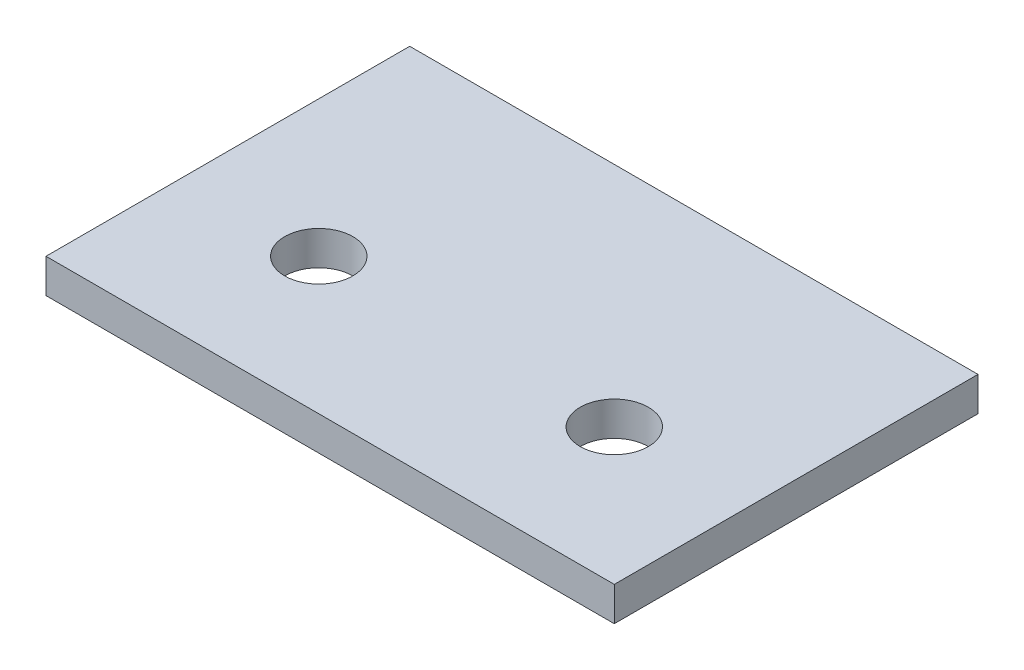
ISO-10303-21;
HEADER;
FILE_DESCRIPTION(('STEP AP214'),'2;1');
FILE_NAME('part.step','',(''),(''),'','','');
FILE_SCHEMA(('AUTOMOTIVE_DESIGN { 1 0 10303 214 1 1 1 1 }'));
ENDSEC;
DATA;
#1=APPLICATION_CONTEXT('core data for automotive mechanical design processes');
#2=APPLICATION_PROTOCOL_DEFINITION('international standard','automotive_design',2000,#1);
#3=PRODUCT_CONTEXT('',#1,'mechanical');
#4=PRODUCT('Part','Part','',(#3));
#5=PRODUCT_RELATED_PRODUCT_CATEGORY('part','',(#4));
#6=PRODUCT_DEFINITION_FORMATION('','',#4);
#7=PRODUCT_DEFINITION_CONTEXT('part definition',#1,'design');
#8=PRODUCT_DEFINITION('design','',#6,#7);
#9=PRODUCT_DEFINITION_SHAPE('','',#8);
#10=(LENGTH_UNIT() NAMED_UNIT(*) SI_UNIT(.MILLI.,.METRE.));
#11=(NAMED_UNIT(*) PLANE_ANGLE_UNIT() SI_UNIT($,.RADIAN.));
#12=(NAMED_UNIT(*) SI_UNIT($,.STERADIAN.) SOLID_ANGLE_UNIT());
#13=UNCERTAINTY_MEASURE_WITH_UNIT(LENGTH_MEASURE(1.E-05),#10,'distance_accuracy_value','');
#14=(GEOMETRIC_REPRESENTATION_CONTEXT(3) GLOBAL_UNCERTAINTY_ASSIGNED_CONTEXT((#13)) GLOBAL_UNIT_ASSIGNED_CONTEXT((#10,
#11,#12)) REPRESENTATION_CONTEXT('',''));
#15=CARTESIAN_POINT('',(0.,0.,0.));
#16=DIRECTION('',(0.,0.,1.));
#17=DIRECTION('',(1.,0.,0.));
#18=AXIS2_PLACEMENT_3D('',#15,#16,#17);
#19=CARTESIAN_POINT('',(0.,1.5,0.));
#20=DIRECTION('',(0.,-1.,0.));
#21=DIRECTION('',(0.,0.,-1.));
#22=AXIS2_PLACEMENT_3D('',#19,#20,#21);
#23=PLANE('',#22);
#24=DIRECTION('',(0.,0.,1.));
#25=VECTOR('',#24,1.);
#26=CARTESIAN_POINT('',(0.,1.5,0.));
#27=LINE('',#26,#25);
#28=CARTESIAN_POINT('',(0.,1.5,-16.));
#29=VERTEX_POINT('',#28);
#30=CARTESIAN_POINT('',(0.,1.5,0.));
#31=VERTEX_POINT('',#30);
#32=EDGE_CURVE('E84',#29,#31,#27,.T.);
#33=ORIENTED_EDGE('',*,*,#32,.T.);
#34=DIRECTION('',(1.,0.,0.));
#35=VECTOR('',#34,1.);
#36=CARTESIAN_POINT('',(0.,1.5,0.));
#37=LINE('',#36,#35);
#38=CARTESIAN_POINT('',(25.,1.5,0.));
#39=VERTEX_POINT('',#38);
#40=EDGE_CURVE('E79',#31,#39,#37,.T.);
#41=ORIENTED_EDGE('',*,*,#40,.T.);
#42=DIRECTION('',(0.,0.,-1.));
#43=VECTOR('',#42,1.);
#44=CARTESIAN_POINT('',(25.,1.5,0.));
#45=LINE('',#44,#43);
#46=CARTESIAN_POINT('',(25.,1.5,-16.));
#47=VERTEX_POINT('',#46);
#48=EDGE_CURVE('E82',#39,#47,#45,.T.);
#49=ORIENTED_EDGE('',*,*,#48,.T.);
#50=DIRECTION('',(-1.,0.,0.));
#51=VECTOR('',#50,1.);
#52=CARTESIAN_POINT('',(0.,1.5,-16.));
#53=LINE('',#52,#51);
#54=EDGE_CURVE('E49',#47,#29,#53,.T.);
#55=ORIENTED_EDGE('',*,*,#54,.T.);
#56=EDGE_LOOP('',(#33,#41,#49,#55));
#57=FACE_BOUND('',#56,.T.);
#58=CARTESIAN_POINT('',(6.,1.5,-6.));
#59=DIRECTION('',(0.,1.,0.));
#60=DIRECTION('',(0.,0.,1.));
#61=AXIS2_PLACEMENT_3D('',#58,#59,#60);
#62=CIRCLE('',#61,1.5);
#63=CARTESIAN_POINT('',(6.,1.5,-4.5));
#64=VERTEX_POINT('',#63);
#65=EDGE_CURVE('E99',#64,#64,#62,.T.);
#66=ORIENTED_EDGE('',*,*,#65,.F.);
#67=EDGE_LOOP('',(#66));
#68=FACE_BOUND('',#67,.T.);
#69=CARTESIAN_POINT('',(19.,1.5,-6.));
#70=DIRECTION('',(0.,1.,0.));
#71=DIRECTION('',(0.,0.,1.));
#72=AXIS2_PLACEMENT_3D('',#69,#70,#71);
#73=CIRCLE('',#72,1.5);
#74=CARTESIAN_POINT('',(19.,1.5,-4.5));
#75=VERTEX_POINT('',#74);
#76=EDGE_CURVE('E114',#75,#75,#73,.T.);
#77=ORIENTED_EDGE('',*,*,#76,.F.);
#78=EDGE_LOOP('',(#77));
#79=FACE_BOUND('',#78,.T.);
#80=ADVANCED_FACE('F32',(#57,#68,#79),#23,.F.);
#81=CARTESIAN_POINT('',(0.,0.,0.));
#82=DIRECTION('',(0.,-1.,0.));
#83=DIRECTION('',(0.,0.,-1.));
#84=AXIS2_PLACEMENT_3D('',#81,#82,#83);
#85=PLANE('',#84);
#86=CARTESIAN_POINT('',(6.,0.,-6.));
#87=DIRECTION('',(0.,1.,0.));
#88=DIRECTION('',(0.,0.,1.));
#89=AXIS2_PLACEMENT_3D('',#86,#87,#88);
#90=CIRCLE('',#89,1.5);
#91=CARTESIAN_POINT('',(6.,0.,-4.5));
#92=VERTEX_POINT('',#91);
#93=EDGE_CURVE('E111',#92,#92,#90,.T.);
#94=ORIENTED_EDGE('',*,*,#93,.T.);
#95=EDGE_LOOP('',(#94));
#96=FACE_BOUND('',#95,.T.);
#97=DIRECTION('',(0.,0.,1.));
#98=VECTOR('',#97,1.);
#99=CARTESIAN_POINT('',(0.,0.,0.));
#100=LINE('',#99,#98);
#101=CARTESIAN_POINT('',(0.,0.,-16.));
#102=VERTEX_POINT('',#101);
#103=CARTESIAN_POINT('',(0.,0.,0.));
#104=VERTEX_POINT('',#103);
#105=EDGE_CURVE('E96',#102,#104,#100,.T.);
#106=ORIENTED_EDGE('',*,*,#105,.F.);
#107=DIRECTION('',(-1.,0.,0.));
#108=VECTOR('',#107,1.);
#109=CARTESIAN_POINT('',(0.,0.,-16.));
#110=LINE('',#109,#108);
#111=CARTESIAN_POINT('',(25.,0.,-16.));
#112=VERTEX_POINT('',#111);
#113=EDGE_CURVE('E72',#112,#102,#110,.T.);
#114=ORIENTED_EDGE('',*,*,#113,.F.);
#115=DIRECTION('',(0.,0.,-1.));
#116=VECTOR('',#115,1.);
#117=CARTESIAN_POINT('',(25.,0.,0.));
#118=LINE('',#117,#116);
#119=CARTESIAN_POINT('',(25.,0.,0.));
#120=VERTEX_POINT('',#119);
#121=EDGE_CURVE('E66',#120,#112,#118,.T.);
#122=ORIENTED_EDGE('',*,*,#121,.F.);
#123=DIRECTION('',(1.,0.,0.));
#124=VECTOR('',#123,1.);
#125=CARTESIAN_POINT('',(0.,0.,0.));
#126=LINE('',#125,#124);
#127=EDGE_CURVE('E88',#104,#120,#126,.T.);
#128=ORIENTED_EDGE('',*,*,#127,.F.);
#129=EDGE_LOOP('',(#106,#114,#122,#128));
#130=FACE_BOUND('',#129,.T.);
#131=CARTESIAN_POINT('',(19.,0.,-6.));
#132=DIRECTION('',(0.,1.,0.));
#133=DIRECTION('',(0.,0.,1.));
#134=AXIS2_PLACEMENT_3D('',#131,#132,#133);
#135=CIRCLE('',#134,1.5);
#136=CARTESIAN_POINT('',(19.,0.,-4.5));
#137=VERTEX_POINT('',#136);
#138=EDGE_CURVE('E117',#137,#137,#135,.T.);
#139=ORIENTED_EDGE('',*,*,#138,.T.);
#140=EDGE_LOOP('',(#139));
#141=FACE_BOUND('',#140,.T.);
#142=ADVANCED_FACE('F107',(#96,#130,#141),#85,.T.);
#143=CARTESIAN_POINT('',(0.,1.5,0.));
#144=DIRECTION('',(1.,0.,0.));
#145=DIRECTION('',(0.,0.,-1.));
#146=AXIS2_PLACEMENT_3D('',#143,#144,#145);
#147=PLANE('',#146);
#148=ORIENTED_EDGE('',*,*,#105,.T.);
#149=DIRECTION('',(0.,-1.,0.));
#150=VECTOR('',#149,1.);
#151=CARTESIAN_POINT('',(0.,1.5,0.));
#152=LINE('',#151,#150);
#153=EDGE_CURVE('E11',#31,#104,#152,.T.);
#154=ORIENTED_EDGE('',*,*,#153,.F.);
#155=ORIENTED_EDGE('',*,*,#32,.F.);
#156=DIRECTION('',(0.,-1.,0.));
#157=VECTOR('',#156,1.);
#158=CARTESIAN_POINT('',(0.,1.5,-16.));
#159=LINE('',#158,#157);
#160=EDGE_CURVE('E92',#29,#102,#159,.T.);
#161=ORIENTED_EDGE('',*,*,#160,.T.);
#162=EDGE_LOOP('',(#148,#154,#155,#161));
#163=FACE_BOUND('',#162,.T.);
#164=ADVANCED_FACE('F34',(#163),#147,.F.);
#165=CARTESIAN_POINT('',(0.,1.5,0.));
#166=DIRECTION('',(0.,0.,-1.));
#167=DIRECTION('',(-1.,0.,0.));
#168=AXIS2_PLACEMENT_3D('',#165,#166,#167);
#169=PLANE('',#168);
#170=ORIENTED_EDGE('',*,*,#127,.T.);
#171=DIRECTION('',(0.,-1.,0.));
#172=VECTOR('',#171,1.);
#173=CARTESIAN_POINT('',(25.,1.5,0.));
#174=LINE('',#173,#172);
#175=EDGE_CURVE('E41',#39,#120,#174,.T.);
#176=ORIENTED_EDGE('',*,*,#175,.F.);
#177=ORIENTED_EDGE('',*,*,#40,.F.);
#178=ORIENTED_EDGE('',*,*,#153,.T.);
#179=EDGE_LOOP('',(#170,#176,#177,#178));
#180=FACE_BOUND('',#179,.T.);
#181=ADVANCED_FACE('F87',(#180),#169,.F.);
#182=CARTESIAN_POINT('',(25.,1.5,0.));
#183=DIRECTION('',(-1.,0.,0.));
#184=DIRECTION('',(0.,0.,1.));
#185=AXIS2_PLACEMENT_3D('',#182,#183,#184);
#186=PLANE('',#185);
#187=ORIENTED_EDGE('',*,*,#121,.T.);
#188=DIRECTION('',(0.,-1.,0.));
#189=VECTOR('',#188,1.);
#190=CARTESIAN_POINT('',(25.,1.5,-16.));
#191=LINE('',#190,#189);
#192=EDGE_CURVE('E89',#47,#112,#191,.T.);
#193=ORIENTED_EDGE('',*,*,#192,.F.);
#194=ORIENTED_EDGE('',*,*,#48,.F.);
#195=ORIENTED_EDGE('',*,*,#175,.T.);
#196=EDGE_LOOP('',(#187,#193,#194,#195));
#197=FACE_BOUND('',#196,.T.);
#198=ADVANCED_FACE('F90',(#197),#186,.F.);
#199=CARTESIAN_POINT('',(0.,1.5,-16.));
#200=DIRECTION('',(0.,0.,1.));
#201=DIRECTION('',(1.,0.,0.));
#202=AXIS2_PLACEMENT_3D('',#199,#200,#201);
#203=PLANE('',#202);
#204=ORIENTED_EDGE('',*,*,#113,.T.);
#205=ORIENTED_EDGE('',*,*,#160,.F.);
#206=ORIENTED_EDGE('',*,*,#54,.F.);
#207=ORIENTED_EDGE('',*,*,#192,.T.);
#208=EDGE_LOOP('',(#204,#205,#206,#207));
#209=FACE_BOUND('',#208,.T.);
#210=ADVANCED_FACE('F104',(#209),#203,.F.);
#211=CARTESIAN_POINT('',(6.,1.5,-6.));
#212=DIRECTION('',(0.,-1.,0.));
#213=DIRECTION('',(0.,0.,-1.));
#214=AXIS2_PLACEMENT_3D('',#211,#212,#213);
#215=CYLINDRICAL_SURFACE('',#214,1.5);
#216=ORIENTED_EDGE('',*,*,#65,.T.);
#217=EDGE_LOOP('',(#216));
#218=FACE_BOUND('',#217,.T.);
#219=ORIENTED_EDGE('',*,*,#93,.F.);
#220=EDGE_LOOP('',(#219));
#221=FACE_BOUND('',#220,.T.);
#222=ADVANCED_FACE('F134',(#218,#221),#215,.F.);
#223=CARTESIAN_POINT('',(19.,1.5,-6.));
#224=DIRECTION('',(0.,-1.,0.));
#225=DIRECTION('',(0.,0.,-1.));
#226=AXIS2_PLACEMENT_3D('',#223,#224,#225);
#227=CYLINDRICAL_SURFACE('',#226,1.5);
#228=ORIENTED_EDGE('',*,*,#76,.T.);
#229=EDGE_LOOP('',(#228));
#230=FACE_BOUND('',#229,.T.);
#231=ORIENTED_EDGE('',*,*,#138,.F.);
#232=EDGE_LOOP('',(#231));
#233=FACE_BOUND('',#232,.T.);
#234=ADVANCED_FACE('F123',(#230,#233),#227,.F.);
#235=CLOSED_SHELL('',(#80,#142,#164,#181,#198,#210,#222,#234));
#236=MANIFOLD_SOLID_BREP('B2',#235);
#237=ADVANCED_BREP_SHAPE_REPRESENTATION('',(#18,#236),#14);
#238=SHAPE_DEFINITION_REPRESENTATION(#9,#237);
ENDSEC;
END-ISO-10303-21;
